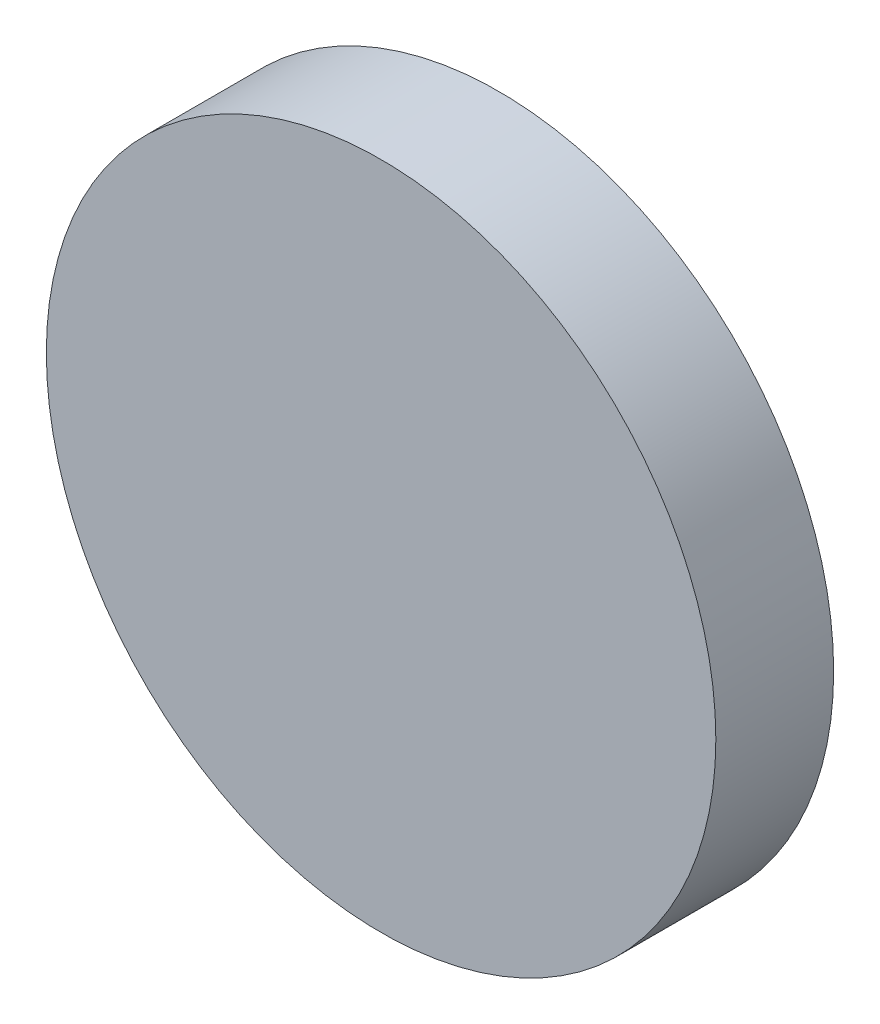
ISO-10303-21;
HEADER;
FILE_DESCRIPTION(('STEP AP214'),'2;1');
FILE_NAME('part.step','',(''),(''),'','','');
FILE_SCHEMA(('AUTOMOTIVE_DESIGN { 1 0 10303 214 1 1 1 1 }'));
ENDSEC;
DATA;
#1=APPLICATION_CONTEXT('core data for automotive mechanical design processes');
#2=APPLICATION_PROTOCOL_DEFINITION('international standard','automotive_design',2000,#1);
#3=PRODUCT_CONTEXT('',#1,'mechanical');
#4=PRODUCT('Part','Part','',(#3));
#5=PRODUCT_RELATED_PRODUCT_CATEGORY('part','',(#4));
#6=PRODUCT_DEFINITION_FORMATION('','',#4);
#7=PRODUCT_DEFINITION_CONTEXT('part definition',#1,'design');
#8=PRODUCT_DEFINITION('design','',#6,#7);
#9=PRODUCT_DEFINITION_SHAPE('','',#8);
#10=(LENGTH_UNIT() NAMED_UNIT(*) SI_UNIT(.MILLI.,.METRE.));
#11=(NAMED_UNIT(*) PLANE_ANGLE_UNIT() SI_UNIT($,.RADIAN.));
#12=(NAMED_UNIT(*) SI_UNIT($,.STERADIAN.) SOLID_ANGLE_UNIT());
#13=UNCERTAINTY_MEASURE_WITH_UNIT(LENGTH_MEASURE(1.E-05),#10,'distance_accuracy_value','');
#14=(GEOMETRIC_REPRESENTATION_CONTEXT(3) GLOBAL_UNCERTAINTY_ASSIGNED_CONTEXT((#13)) GLOBAL_UNIT_ASSIGNED_CONTEXT((#10,
#11,#12)) REPRESENTATION_CONTEXT('',''));
#15=CARTESIAN_POINT('',(0.,0.,0.));
#16=DIRECTION('',(0.,0.,1.));
#17=DIRECTION('',(1.,0.,0.));
#18=AXIS2_PLACEMENT_3D('',#15,#16,#17);
#19=CARTESIAN_POINT('',(0.,0.,22.352));
#20=DIRECTION('',(0.,0.,-1.));
#21=DIRECTION('',(-1.,0.,0.));
#22=AXIS2_PLACEMENT_3D('',#19,#20,#21);
#23=CYLINDRICAL_SURFACE('',#22,63.5);
#24=CARTESIAN_POINT('',(0.,0.,22.352));
#25=DIRECTION('',(0.,0.,1.));
#26=DIRECTION('',(1.,0.,0.));
#27=AXIS2_PLACEMENT_3D('',#24,#25,#26);
#28=CIRCLE('',#27,63.5);
#29=CARTESIAN_POINT('',(63.5,0.,22.352));
#30=VERTEX_POINT('',#29);
#31=EDGE_CURVE('E10',#30,#30,#28,.T.);
#32=ORIENTED_EDGE('',*,*,#31,.F.);
#33=EDGE_LOOP('',(#32));
#34=FACE_BOUND('',#33,.T.);
#35=CARTESIAN_POINT('',(0.,0.,0.));
#36=DIRECTION('',(0.,0.,1.));
#37=DIRECTION('',(1.,0.,0.));
#38=AXIS2_PLACEMENT_3D('',#35,#36,#37);
#39=CIRCLE('',#38,63.5);
#40=CARTESIAN_POINT('',(63.5,0.,0.));
#41=VERTEX_POINT('',#40);
#42=EDGE_CURVE('E44',#41,#41,#39,.T.);
#43=ORIENTED_EDGE('',*,*,#42,.T.);
#44=EDGE_LOOP('',(#43));
#45=FACE_BOUND('',#44,.T.);
#46=ADVANCED_FACE('F41',(#34,#45),#23,.T.);
#47=CARTESIAN_POINT('',(0.,0.,22.352));
#48=DIRECTION('',(0.,0.,1.));
#49=DIRECTION('',(1.,0.,0.));
#50=AXIS2_PLACEMENT_3D('',#47,#48,#49);
#51=PLANE('',#50);
#52=ORIENTED_EDGE('',*,*,#31,.T.);
#53=EDGE_LOOP('',(#52));
#54=FACE_BOUND('',#53,.T.);
#55=ADVANCED_FACE('F56',(#54),#51,.T.);
#56=CARTESIAN_POINT('',(0.,0.,0.));
#57=DIRECTION('',(0.,0.,1.));
#58=DIRECTION('',(1.,0.,0.));
#59=AXIS2_PLACEMENT_3D('',#56,#57,#58);
#60=PLANE('',#59);
#61=ORIENTED_EDGE('',*,*,#42,.F.);
#62=EDGE_LOOP('',(#61));
#63=FACE_BOUND('',#62,.T.);
#64=ADVANCED_FACE('F54',(#63),#60,.F.);
#65=CLOSED_SHELL('',(#46,#55,#64));
#66=MANIFOLD_SOLID_BREP('B2',#65);
#67=ADVANCED_BREP_SHAPE_REPRESENTATION('',(#18,#66),#14);
#68=SHAPE_DEFINITION_REPRESENTATION(#9,#67);
ENDSEC;
END-ISO-10303-21;
